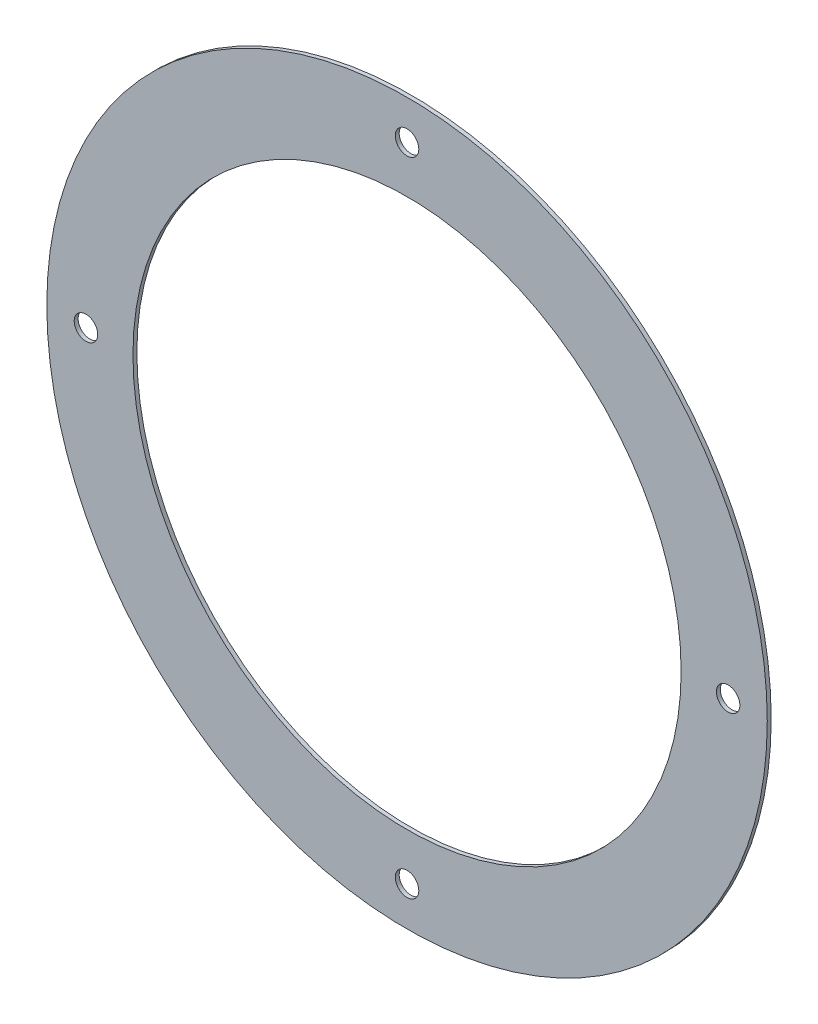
from build123d import *

# Parameters (mm, degrees)
ESQUISSE1_R             = 92
ESQUISSE1_R_2           = 70
BASE_EXTRUSION_DEPTH    = 1
ESQUISSE3_R             = 3
ENL_V_MAT_EXTRU_1_DEPTH = 131.111490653


with BuildPart() as part:
    # Esquisse1 → Base-Extrusion (new body)
    with BuildSketch(Plane.XY):
        Circle(ESQUISSE1_R)
        Circle(ESQUISSE1_R_2, mode=Mode.SUBTRACT)
    extrude(amount=BASE_EXTRUSION_DEPTH)

    # Esquisse3 → Enl_v. mat.-Extru.1 (cut, through all)
    with BuildSketch(Plane.XY.offset(1)):
        with Locations((0, 82)):
            Circle(ESQUISSE3_R)
        with Locations((-82, 0)):
            Circle(ESQUISSE3_R)
        with Locations((82, 0)):
            Circle(ESQUISSE3_R)
        with Locations((0, -82)):
            Circle(ESQUISSE3_R)
    extrude(amount=-ENL_V_MAT_EXTRU_1_DEPTH, mode=Mode.SUBTRACT)


solid = part.part
